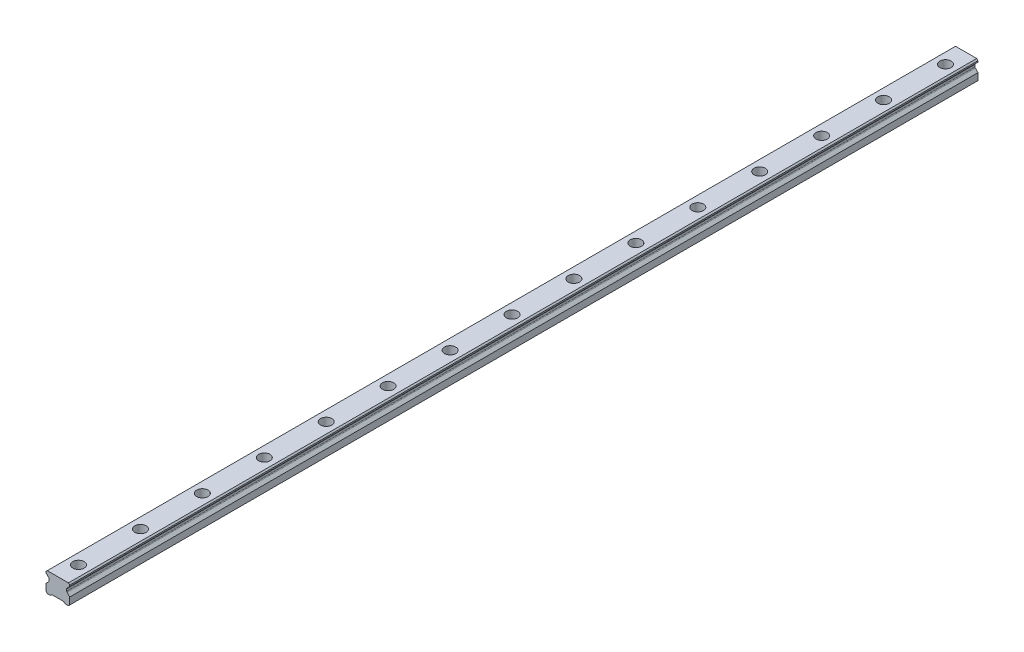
from build123d import *

# Parameters (mm, degrees)
SKETCH1_W           = 23
SKETCH1_H           = 19.2
BOSS_EXTRUDE1_DEPTH = 440
CUT_EXTRUDE1_DEPTH  = 881.284550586
CHAMFER1_SIZE       = 1.25
FILLET1_R           = 1.25
CUT_EXTRUDE2_DEPTH  = 881.284550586
SKETCH4_R           = 5.5
SKETCH4_R_2         = 3.5
CUT_EXTRUDE3_DEPTH  = 9
SKETCH4_2_R         = 3.5
CUT_EXTRUDE4_DEPTH  = 441.568825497
LPATTERN1_COUNT     = 15
LPATTERN1_PITCH     = 60


with BuildPart() as part:
    # Sketch1 → Boss-Extrude1 (new, symmetric)
    with BuildSketch(Plane.XY):
        with Locations((0, 9.6)):
            Rectangle(SKETCH1_W, SKETCH1_H)
    extrude(amount=BOSS_EXTRUDE1_DEPTH, both=True)

    # Sketch2 → Cut-Extrude1 (cut, through all)
    with BuildSketch(Plane.XY.offset(440)):
        Polygon((-11.5, 16.7), (-11.5, 7.95), (-8.583333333, 10.866666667), (-8.583333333, 13.783333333), align=None)
        Polygon((8.583333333, 13.783333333), (11.5, 16.7), (11.5, 7.95), (8.583333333, 10.866666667), align=None)
    extrude(amount=-CUT_EXTRUDE1_DEPTH, mode=Mode.SUBTRACT)

    # Chamfer1
    chamfer1_edges = [part.edges().sort_by_distance(p)[0] for p in [
        (-11.5, 19.2, 0),
        (11.5, 19.2, 0),
        (11.5, 0, 0),
        (-11.5, 0, 0),
    ]]
    chamfer(chamfer1_edges, length=CHAMFER1_SIZE)

    # Fillet1
    fillet1_edges = [part.edges().sort_by_distance(p)[0] for p in [
        (-8.583333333, 13.783333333, 0),
        (-8.583333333, 10.866666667, 0),
        (8.583333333, 10.866666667, 0),
        (8.583333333, 13.783333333, 0),
    ]]
    fillet(fillet1_edges, radius=FILLET1_R)

    # Sketch3 → Cut-Extrude2 (cut, through all)
    with BuildSketch(Plane.XY.offset(440)):
        Polygon((-7, 0), (-5.75, 1.25), (5.75, 1.25), (7, 0), align=None)
    extrude(amount=-CUT_EXTRUDE2_DEPTH, mode=Mode.SUBTRACT)

    # Sketch4 → Cut-Extrude3 (cut)
    with BuildSketch(Plane(origin=(0, 19.2, 0), x_dir=(1, 0, 0), z_dir=(0, 1, 0))):
        with Locations(Location((0, -420, 0), (0, 0, 270))):
            Circle(SKETCH4_R)
        with Locations(Location((0, -420, 0), (0, 0, 270))):
            Circle(SKETCH4_R_2, mode=Mode.SUBTRACT)
    cut_extrude3 = extrude(amount=-CUT_EXTRUDE3_DEPTH, mode=Mode.SUBTRACT)

    # Sketch4_2 → Cut-Extrude4 (cut, through all)
    with BuildSketch(Plane(origin=(0, 19.2, 0), x_dir=(1, 0, 0), z_dir=(0, 1, 0))):
        with Locations(Location((0, -420, 0), (0, 0, 270))):
            Circle(SKETCH4_2_R)
    cut_extrude4 = extrude(amount=-CUT_EXTRUDE4_DEPTH, mode=Mode.SUBTRACT)

    # LPattern1: Cut-Extrude3, Cut-Extrude4 ×15
    with Locations(*[(0, 0, -i * LPATTERN1_PITCH) for i in range(1, LPATTERN1_COUNT)]):
        add(cut_extrude3, mode=Mode.SUBTRACT)
        add(cut_extrude4, mode=Mode.SUBTRACT)


solid = part.part
